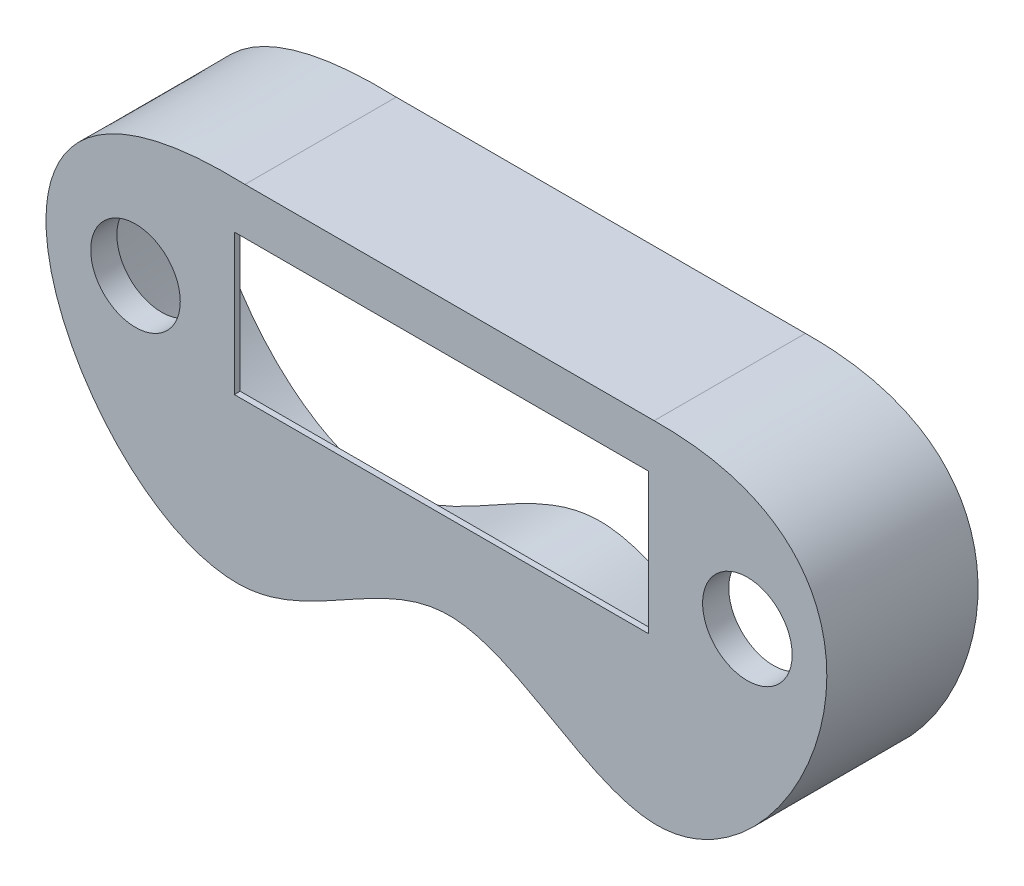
from build123d import *

# Parameters (mm, degrees)
BOSS_EXTRU_6_DEPTH      = 25
BOSS_EXTRU_7_DEPTH      = 1
ESQUISSE4_R             = 7.7
ESQUISSE4_W             = 71.2
ESQUISSE4_H             = 24.2
ENL_V_MAT_EXTRU_2_DEPTH = 1
ESQUISSE5_R             = 8.7
ESQUISSE5_R_2           = 7.7
BOSS_EXTRU_8_DEPTH      = 3.5


with BuildPart() as part:
    # Esquisse1 → Boss.-Extru.6 (new body)
    with BuildSketch(Plane.XY):
        with BuildLine():
            Line((34.641923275, 60), (105, 60))
            add(Edge.make_bspline(
                [(34.641923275, 60), (-25.358261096, 62.090649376), (19.31648925, -29.195179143), (69.75570867, 26.175136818), (119.49608433, -28.315701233), (156.274302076, 60.709177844), (105, 60)],
                knots=[0, 0, 0, 0, 0.360734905, 0.513077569, 0.664071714, 1, 1, 1, 1], degree=3))
        make_face()
        with BuildLine():
            Line((34.624506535, 59), (105.006915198, 59))
            add(Edge.make_bspline(
                [(105.006915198, 59), (105.58346016, 59.007974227), (106.752011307, 59.008090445), (108.966747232, 58.943056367), (111.593085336, 58.744310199), (114.496149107, 58.327868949), (118.053041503, 57.549761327), (121.921890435, 56.186151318), (125.699578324, 54.009377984), (128.678526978, 51.368890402), (131.674290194, 47.314421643), (133.733239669, 41.373955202), (133.816286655, 33.338464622), (131.806173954, 25.007179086), (128.049800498, 17.012056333), (122.919330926, 9.978265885), (116.806001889, 4.519360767), (111.245995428, 1.779710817), (106.720157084, 0.922830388), (102.204810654, 1.053306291), (96.378078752, 2.981923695), (89.195009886, 6.891735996), (83.116739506, 10.381773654), (78.186642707, 12.637081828), (74.446081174, 13.883623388), (70.642557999, 14.507126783), (66.815062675, 14.274961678), (63.070910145, 13.32689657), (58.14807453, 11.373833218), (52.093359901, 8.062664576), (44.896576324, 3.99869869), (38.949599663, 1.595021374), (34.262565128, 0.859459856), (29.547557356, 1.067549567), (23.618506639, 2.942996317), (16.844892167, 7.352969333), (10.81975901, 13.424852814), (5.937929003, 20.636092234), (2.577511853, 28.451071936), (1.098379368, 36.324853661), (1.825730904, 43.708803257), (4.500384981, 49.05691992), (8.073936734, 52.675561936), (11.540154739, 55.007725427), (15.856987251, 56.892453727), (20.210936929, 58.028848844), (24.17348573, 58.640028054), (27.388924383, 58.940388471), (30.282299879, 59.051201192), (32.713930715, 59.052393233), (33.993138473, 59.02199942), (34.624506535, 59)],
                knots=[-3.4883e-05, -3.4883e-05, -3.4883e-05, -3.4883e-05, 0.003871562, 0.007778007, 0.015590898, 0.023403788, 0.031216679, 0.04684246, 0.062468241, 0.078094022, 0.093719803, 0.124971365, 0.156222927, 0.187474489, 0.218726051, 0.249977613, 0.281229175, 0.312480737, 0.328106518, 0.343732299, 0.374983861, 0.406235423, 0.437486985, 0.453112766, 0.468738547, 0.484364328, 0.499990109, 0.51561589, 0.531241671, 0.562493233, 0.593744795, 0.624996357, 0.640622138, 0.656247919, 0.68749948, 0.718751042, 0.750002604, 0.781254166, 0.812505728, 0.84375729, 0.875008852, 0.906260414, 0.921886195, 0.937511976, 0.953137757, 0.968763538, 0.976576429, 0.984389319, 0.99220221, 0.996108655, 1.0000151, 1.0000151, 1.0000151, 1.0000151], degree=3))
        make_face(mode=Mode.SUBTRACT)
    extrude(amount=BOSS_EXTRU_6_DEPTH)

    # Esquisse3 → Boss.-Extru.7 (add)
    with BuildSketch(Plane.XY.offset(25)):
        with BuildLine():
            Line((105, 60), (34.641923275, 60))
            add(Edge.make_bspline(
                [(34.641923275, 60), (-25.358261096, 62.090649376), (19.31648925, -29.195179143), (69.75570867, 26.175136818), (119.49608433, -28.315701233), (156.274302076, 60.709177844), (105, 60)],
                knots=[0, 0, 0, 0, 0.360734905, 0.513077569, 0.664071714, 1, 1, 1, 1], degree=3))
        make_face()
    extrude(amount=BOSS_EXTRU_7_DEPTH)

    # Esquisse4 → Enl_v. mat.-Extru.2 (cut)
    with BuildSketch(Plane.XY.offset(26)):
        with Locations((15.820961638, 37)):
            Circle(ESQUISSE4_R)
        with Locations((121.020961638, 37)):
            Circle(ESQUISSE4_R)
        with Locations((68.420961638, 39.9)):
            Rectangle(ESQUISSE4_W, ESQUISSE4_H)
    extrude(amount=-ENL_V_MAT_EXTRU_2_DEPTH, mode=Mode.SUBTRACT)

    # Esquisse5 → Boss.-Extru.8 (add)
    # profile 1 of 2: a face of its own
    with BuildSketch(Plane(origin=(0, 0, 25), x_dir=(-1, 0, 0), z_dir=(0, 0, -1))):
        with Locations((-121.020961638, 37)):
            Circle(ESQUISSE5_R)
        with Locations(Location((-121.020961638, 37, 0), (0, 0, 180))):
            Circle(ESQUISSE5_R_2, mode=Mode.SUBTRACT)
    # profile 2 of 2: a face of its own
    with BuildSketch(Plane(origin=(0, 0, 25), x_dir=(-1, 0, 0), z_dir=(0, 0, -1))):
        with Locations((-15.820961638, 37)):
            Circle(ESQUISSE5_R)
        with Locations(Location((-15.820961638, 37, 0), (0, 0, 180))):
            Circle(ESQUISSE5_R_2, mode=Mode.SUBTRACT)
    extrude(amount=BOSS_EXTRU_8_DEPTH)


solid = part.part
